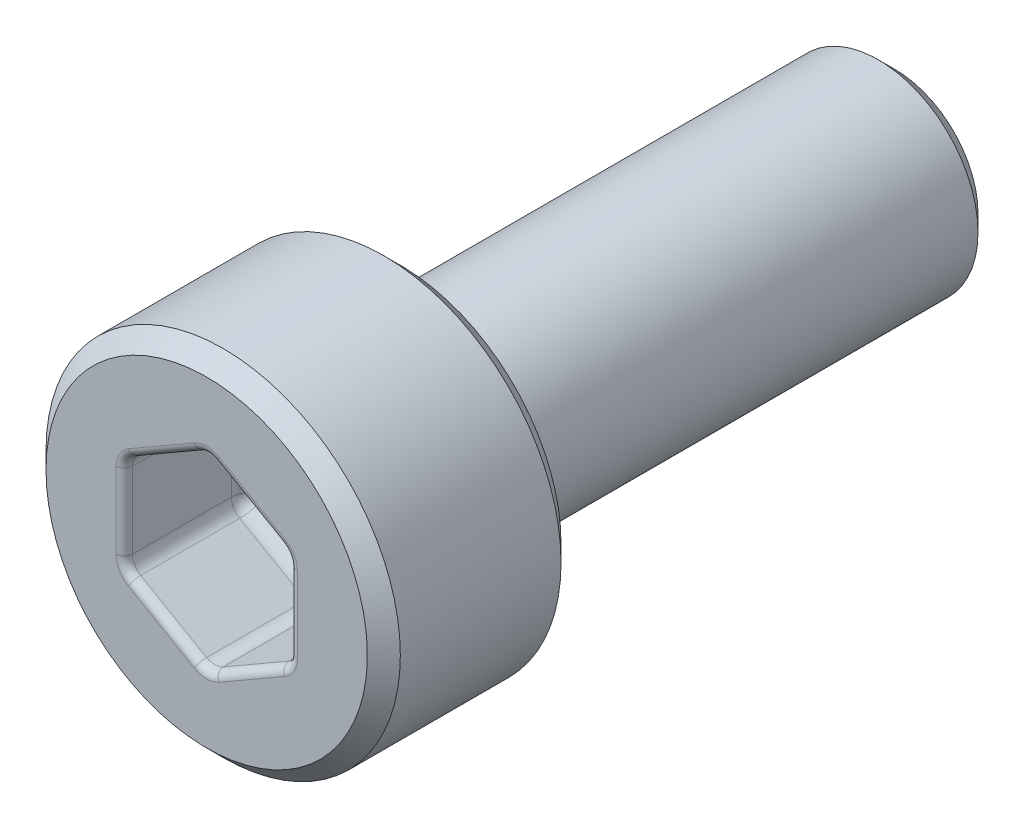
ISO-10303-21;
HEADER;
FILE_DESCRIPTION(('STEP AP214'),'2;1');
FILE_NAME('part.step','',(''),(''),'','','');
FILE_SCHEMA(('AUTOMOTIVE_DESIGN { 1 0 10303 214 1 1 1 1 }'));
ENDSEC;
DATA;
#1=APPLICATION_CONTEXT('core data for automotive mechanical design processes');
#2=APPLICATION_PROTOCOL_DEFINITION('international standard','automotive_design',2000,#1);
#3=PRODUCT_CONTEXT('',#1,'mechanical');
#4=PRODUCT('Part','Part','',(#3));
#5=PRODUCT_RELATED_PRODUCT_CATEGORY('part','',(#4));
#6=PRODUCT_DEFINITION_FORMATION('','',#4);
#7=PRODUCT_DEFINITION_CONTEXT('part definition',#1,'design');
#8=PRODUCT_DEFINITION('design','',#6,#7);
#9=PRODUCT_DEFINITION_SHAPE('','',#8);
#10=(LENGTH_UNIT() NAMED_UNIT(*) SI_UNIT(.MILLI.,.METRE.));
#11=(NAMED_UNIT(*) PLANE_ANGLE_UNIT() SI_UNIT($,.RADIAN.));
#12=(NAMED_UNIT(*) SI_UNIT($,.STERADIAN.) SOLID_ANGLE_UNIT());
#13=UNCERTAINTY_MEASURE_WITH_UNIT(LENGTH_MEASURE(1.E-05),#10,'distance_accuracy_value','');
#14=(GEOMETRIC_REPRESENTATION_CONTEXT(3) GLOBAL_UNCERTAINTY_ASSIGNED_CONTEXT((#13)) GLOBAL_UNIT_ASSIGNED_CONTEXT((#10,
#11,#12)) REPRESENTATION_CONTEXT('',''));
#15=CARTESIAN_POINT('',(0.,0.,0.));
#16=DIRECTION('',(0.,0.,1.));
#17=DIRECTION('',(1.,0.,0.));
#18=AXIS2_PLACEMENT_3D('',#15,#16,#17);
#19=CARTESIAN_POINT('',(0.,0.,2.35));
#20=DIRECTION('',(0.,0.,-1.));
#21=DIRECTION('',(-1.,0.,0.));
#22=AXIS2_PLACEMENT_3D('',#19,#20,#21);
#23=PLANE('',#22);
#24=DIRECTION('',(0.,1.,0.));
#25=VECTOR('',#24,1.);
#26=CARTESIAN_POINT('',(1.1,0.,2.35));
#27=LINE('',#26,#25);
#28=CARTESIAN_POINT('',(1.1,0.4618802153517,2.35));
#29=VERTEX_POINT('',#28);
#30=CARTESIAN_POINT('',(1.1,-0.461880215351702,2.35));
#31=VERTEX_POINT('',#30);
#32=EDGE_CURVE('E268',#29,#31,#27,.F.);
#33=ORIENTED_EDGE('',*,*,#32,.T.);
#34=CARTESIAN_POINT('',(0.8,-0.461880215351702,2.35));
#35=DIRECTION('',(0.,0.,-1.));
#36=DIRECTION('',(-1.,0.,0.));
#37=AXIS2_PLACEMENT_3D('',#34,#35,#36);
#38=CIRCLE('',#37,0.3);
#39=CARTESIAN_POINT('',(0.95,-0.721687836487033,2.35));
#40=VERTEX_POINT('',#39);
#41=EDGE_CURVE('E333',#31,#40,#38,.T.);
#42=ORIENTED_EDGE('',*,*,#41,.T.);
#43=DIRECTION('',(0.866025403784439,0.499999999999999,0.));
#44=VECTOR('',#43,1.);
#45=CARTESIAN_POINT('',(0.549999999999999,-0.952627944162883,2.35));
#46=LINE('',#45,#44);
#47=CARTESIAN_POINT('',(0.149999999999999,-1.18356805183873,2.35));
#48=VERTEX_POINT('',#47);
#49=EDGE_CURVE('E331',#40,#48,#46,.F.);
#50=ORIENTED_EDGE('',*,*,#49,.T.);
#51=CARTESIAN_POINT('',(0.,-0.923760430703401,2.35));
#52=DIRECTION('',(0.,0.,-1.));
#53=DIRECTION('',(-1.,0.,0.));
#54=AXIS2_PLACEMENT_3D('',#51,#52,#53);
#55=CIRCLE('',#54,0.3);
#56=CARTESIAN_POINT('',(-0.150000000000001,-1.18356805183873,2.35));
#57=VERTEX_POINT('',#56);
#58=EDGE_CURVE('E329',#48,#57,#55,.T.);
#59=ORIENTED_EDGE('',*,*,#58,.T.);
#60=DIRECTION('',(0.866025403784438,-0.500000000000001,0.));
#61=VECTOR('',#60,1.);
#62=CARTESIAN_POINT('',(-0.550000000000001,-0.952627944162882,2.35));
#63=LINE('',#62,#61);
#64=CARTESIAN_POINT('',(-0.950000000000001,-0.721687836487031,2.35));
#65=VERTEX_POINT('',#64);
#66=EDGE_CURVE('E327',#57,#65,#63,.F.);
#67=ORIENTED_EDGE('',*,*,#66,.T.);
#68=CARTESIAN_POINT('',(-0.800000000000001,-0.4618802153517,2.35));
#69=DIRECTION('',(0.,0.,-1.));
#70=DIRECTION('',(-1.,0.,0.));
#71=AXIS2_PLACEMENT_3D('',#68,#69,#70);
#72=CIRCLE('',#71,0.3);
#73=CARTESIAN_POINT('',(-1.1,-0.4618802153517,2.35));
#74=VERTEX_POINT('',#73);
#75=EDGE_CURVE('E325',#65,#74,#72,.T.);
#76=ORIENTED_EDGE('',*,*,#75,.T.);
#77=DIRECTION('',(0.,-1.,0.));
#78=VECTOR('',#77,1.);
#79=CARTESIAN_POINT('',(-1.1,0.,2.35));
#80=LINE('',#79,#78);
#81=CARTESIAN_POINT('',(-1.1,0.461880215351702,2.35));
#82=VERTEX_POINT('',#81);
#83=EDGE_CURVE('E323',#74,#82,#80,.F.);
#84=ORIENTED_EDGE('',*,*,#83,.T.);
#85=CARTESIAN_POINT('',(-0.8,0.461880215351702,2.35));
#86=DIRECTION('',(0.,0.,-1.));
#87=DIRECTION('',(-1.,0.,0.));
#88=AXIS2_PLACEMENT_3D('',#85,#86,#87);
#89=CIRCLE('',#88,0.3);
#90=CARTESIAN_POINT('',(-0.95,0.721687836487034,2.35));
#91=VERTEX_POINT('',#90);
#92=EDGE_CURVE('E321',#82,#91,#89,.T.);
#93=ORIENTED_EDGE('',*,*,#92,.T.);
#94=DIRECTION('',(-0.866025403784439,-0.499999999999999,0.));
#95=VECTOR('',#94,1.);
#96=CARTESIAN_POINT('',(-0.549999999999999,0.952627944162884,2.35));
#97=LINE('',#96,#95);
#98=CARTESIAN_POINT('',(-0.149999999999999,1.18356805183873,2.35));
#99=VERTEX_POINT('',#98);
#100=EDGE_CURVE('E319',#91,#99,#97,.F.);
#101=ORIENTED_EDGE('',*,*,#100,.T.);
#102=CARTESIAN_POINT('',(0.,0.923760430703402,2.35));
#103=DIRECTION('',(0.,0.,-1.));
#104=DIRECTION('',(-1.,0.,0.));
#105=AXIS2_PLACEMENT_3D('',#102,#103,#104);
#106=CIRCLE('',#105,0.3);
#107=CARTESIAN_POINT('',(0.150000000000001,1.18356805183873,2.35));
#108=VERTEX_POINT('',#107);
#109=EDGE_CURVE('E317',#99,#108,#106,.T.);
#110=ORIENTED_EDGE('',*,*,#109,.T.);
#111=DIRECTION('',(-0.866025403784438,0.500000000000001,0.));
#112=VECTOR('',#111,1.);
#113=CARTESIAN_POINT('',(0.550000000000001,0.952627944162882,2.35));
#114=LINE('',#113,#112);
#115=CARTESIAN_POINT('',(0.950000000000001,0.721687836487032,2.35));
#116=VERTEX_POINT('',#115);
#117=EDGE_CURVE('E315',#108,#116,#114,.F.);
#118=ORIENTED_EDGE('',*,*,#117,.T.);
#119=CARTESIAN_POINT('',(0.8,0.4618802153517,2.35));
#120=DIRECTION('',(0.,0.,-1.));
#121=DIRECTION('',(-1.,0.,0.));
#122=AXIS2_PLACEMENT_3D('',#119,#120,#121);
#123=CIRCLE('',#122,0.3);
#124=EDGE_CURVE('E313',#116,#29,#123,.T.);
#125=ORIENTED_EDGE('',*,*,#124,.T.);
#126=EDGE_LOOP('',(#33,#42,#50,#59,#67,#76,#84,#93,#101,#110,#118,#125));
#127=FACE_BOUND('',#126,.T.);
#128=CARTESIAN_POINT('',(0.,0.,2.35));
#129=DIRECTION('',(0.,0.,-1.));
#130=DIRECTION('',(-1.,0.,0.));
#131=AXIS2_PLACEMENT_3D('',#128,#129,#130);
#132=CIRCLE('',#131,1.95);
#133=CARTESIAN_POINT('',(-1.95,0.,2.35));
#134=VERTEX_POINT('',#133);
#135=EDGE_CURVE('E311',#134,#134,#132,.F.);
#136=ORIENTED_EDGE('',*,*,#135,.T.);
#137=EDGE_LOOP('',(#136));
#138=FACE_BOUND('',#137,.T.);
#139=ADVANCED_FACE('F39',(#127,#138),#23,.F.);
#140=CARTESIAN_POINT('',(0.,0.,21.9198795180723));
#141=DIRECTION('',(0.,0.,1.));
#142=DIRECTION('',(1.,0.,0.));
#143=AXIS2_PLACEMENT_3D('',#140,#141,#142);
#144=CYLINDRICAL_SURFACE('',#143,2.15);
#145=CARTESIAN_POINT('',(0.,0.,2.15));
#146=DIRECTION('',(0.,0.,-1.));
#147=DIRECTION('',(-1.,0.,0.));
#148=AXIS2_PLACEMENT_3D('',#145,#146,#147);
#149=CIRCLE('',#148,2.15);
#150=CARTESIAN_POINT('',(-2.15,0.,2.15));
#151=VERTEX_POINT('',#150);
#152=EDGE_CURVE('E873',#151,#151,#149,.T.);
#153=ORIENTED_EDGE('',*,*,#152,.T.);
#154=EDGE_LOOP('',(#153));
#155=FACE_BOUND('',#154,.T.);
#156=CARTESIAN_POINT('',(0.,0.,0.199999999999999));
#157=DIRECTION('',(0.,0.,1.));
#158=DIRECTION('',(1.,0.,0.));
#159=AXIS2_PLACEMENT_3D('',#156,#157,#158);
#160=CIRCLE('',#159,2.15);
#161=CARTESIAN_POINT('',(2.15,0.,0.199999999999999));
#162=VERTEX_POINT('',#161);
#163=EDGE_CURVE('E878',#162,#162,#160,.T.);
#164=ORIENTED_EDGE('',*,*,#163,.T.);
#165=EDGE_LOOP('',(#164));
#166=FACE_BOUND('',#165,.T.);
#167=ADVANCED_FACE('F432',(#155,#166),#144,.T.);
#168=CARTESIAN_POINT('',(0.,2.15,0.));
#169=DIRECTION('',(0.,0.,1.));
#170=DIRECTION('',(1.,0.,0.));
#171=AXIS2_PLACEMENT_3D('',#168,#169,#170);
#172=PLANE('',#171);
#173=CARTESIAN_POINT('',(0.,0.,0.));
#174=DIRECTION('',(0.,0.,1.));
#175=DIRECTION('',(1.,0.,0.));
#176=AXIS2_PLACEMENT_3D('',#173,#174,#175);
#177=CIRCLE('',#176,1.41);
#178=CARTESIAN_POINT('',(1.41,0.,0.));
#179=VERTEX_POINT('',#178);
#180=EDGE_CURVE('E263',#179,#179,#177,.T.);
#181=ORIENTED_EDGE('',*,*,#180,.T.);
#182=EDGE_LOOP('',(#181));
#183=FACE_BOUND('',#182,.T.);
#184=CARTESIAN_POINT('',(0.,0.,0.));
#185=DIRECTION('',(0.,0.,1.));
#186=DIRECTION('',(1.,0.,0.));
#187=AXIS2_PLACEMENT_3D('',#184,#185,#186);
#188=CIRCLE('',#187,1.95);
#189=CARTESIAN_POINT('',(1.95,0.,0.));
#190=VERTEX_POINT('',#189);
#191=EDGE_CURVE('E871',#190,#190,#188,.F.);
#192=ORIENTED_EDGE('',*,*,#191,.T.);
#193=EDGE_LOOP('',(#192));
#194=FACE_BOUND('',#193,.T.);
#195=ADVANCED_FACE('F438',(#183,#194),#172,.F.);
#196=CARTESIAN_POINT('',(0.,0.,21.9198795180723));
#197=DIRECTION('',(0.,0.,1.));
#198=DIRECTION('',(1.,0.,0.));
#199=AXIS2_PLACEMENT_3D('',#196,#197,#198);
#200=CYLINDRICAL_SURFACE('',#199,1.21);
#201=CARTESIAN_POINT('',(0.,0.,-0.200000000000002));
#202=DIRECTION('',(0.,0.,1.));
#203=DIRECTION('',(1.,0.,0.));
#204=AXIS2_PLACEMENT_3D('',#201,#202,#203);
#205=CIRCLE('',#204,1.21);
#206=CARTESIAN_POINT('',(1.21,0.,-0.200000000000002));
#207=VERTEX_POINT('',#206);
#208=EDGE_CURVE('E266',#207,#207,#205,.F.);
#209=ORIENTED_EDGE('',*,*,#208,.T.);
#210=EDGE_LOOP('',(#209));
#211=FACE_BOUND('',#210,.T.);
#212=CARTESIAN_POINT('',(0.,0.,-5.8));
#213=DIRECTION('',(0.,0.,1.));
#214=DIRECTION('',(1.,0.,0.));
#215=AXIS2_PLACEMENT_3D('',#212,#213,#214);
#216=CIRCLE('',#215,1.21);
#217=CARTESIAN_POINT('',(1.21,0.,-5.8));
#218=VERTEX_POINT('',#217);
#219=EDGE_CURVE('E872',#218,#218,#216,.T.);
#220=ORIENTED_EDGE('',*,*,#219,.T.);
#221=EDGE_LOOP('',(#220));
#222=FACE_BOUND('',#221,.T.);
#223=ADVANCED_FACE('F813',(#211,#222),#200,.T.);
#224=CARTESIAN_POINT('',(0.,1.21,-6.));
#225=DIRECTION('',(0.,0.,1.));
#226=DIRECTION('',(1.,0.,0.));
#227=AXIS2_PLACEMENT_3D('',#224,#225,#226);
#228=PLANE('',#227);
#229=CARTESIAN_POINT('',(0.,0.,-6.));
#230=DIRECTION('',(0.,0.,1.));
#231=DIRECTION('',(1.,0.,0.));
#232=AXIS2_PLACEMENT_3D('',#229,#230,#231);
#233=CIRCLE('',#232,1.01);
#234=CARTESIAN_POINT('',(1.01,0.,-6.));
#235=VERTEX_POINT('',#234);
#236=EDGE_CURVE('E213',#235,#235,#233,.F.);
#237=ORIENTED_EDGE('',*,*,#236,.T.);
#238=EDGE_LOOP('',(#237));
#239=FACE_BOUND('',#238,.T.);
#240=ADVANCED_FACE('F805',(#239),#228,.F.);
#241=CARTESIAN_POINT('',(0.,-1.15470053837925,0.849999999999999));
#242=DIRECTION('',(0.499999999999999,-0.866025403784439,0.));
#243=DIRECTION('',(0.866025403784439,0.499999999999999,0.));
#244=AXIS2_PLACEMENT_3D('',#241,#242,#243);
#245=PLANE('',#244);
#246=DIRECTION('',(0.,0.,1.));
#247=VECTOR('',#246,1.);
#248=CARTESIAN_POINT('',(0.0999999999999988,-1.09696551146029,2.35));
#249=LINE('',#248,#247);
#250=CARTESIAN_POINT('',(0.0999999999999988,-1.09696551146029,1.05));
#251=VERTEX_POINT('',#250);
#252=CARTESIAN_POINT('',(0.0999999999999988,-1.09696551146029,2.25));
#253=VERTEX_POINT('',#252);
#254=EDGE_CURVE('E260',#251,#253,#249,.T.);
#255=ORIENTED_EDGE('',*,*,#254,.T.);
#256=DIRECTION('',(0.866025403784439,0.499999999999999,0.));
#257=VECTOR('',#256,1.);
#258=CARTESIAN_POINT('',(0.,-1.15470053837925,2.25));
#259=LINE('',#258,#257);
#260=CARTESIAN_POINT('',(0.899999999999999,-0.635085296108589,2.25));
#261=VERTEX_POINT('',#260);
#262=EDGE_CURVE('E339',#253,#261,#259,.T.);
#263=ORIENTED_EDGE('',*,*,#262,.T.);
#264=DIRECTION('',(0.,0.,1.));
#265=VECTOR('',#264,1.);
#266=CARTESIAN_POINT('',(0.899999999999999,-0.635085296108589,0.849999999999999));
#267=LINE('',#266,#265);
#268=CARTESIAN_POINT('',(0.899999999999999,-0.635085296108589,1.05));
#269=VERTEX_POINT('',#268);
#270=EDGE_CURVE('E256',#261,#269,#267,.F.);
#271=ORIENTED_EDGE('',*,*,#270,.T.);
#272=DIRECTION('',(0.866025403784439,0.499999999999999,0.));
#273=VECTOR('',#272,1.);
#274=CARTESIAN_POINT('',(0.,-1.15470053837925,1.05));
#275=LINE('',#274,#273);
#276=EDGE_CURVE('E258',#269,#251,#275,.F.);
#277=ORIENTED_EDGE('',*,*,#276,.T.);
#278=EDGE_LOOP('',(#255,#263,#271,#277));
#279=FACE_BOUND('',#278,.T.);
#280=ADVANCED_FACE('F796',(#279),#245,.F.);
#281=CARTESIAN_POINT('',(-1.,-0.577350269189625,0.849999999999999));
#282=DIRECTION('',(-0.500000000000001,-0.866025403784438,0.));
#283=DIRECTION('',(0.866025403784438,-0.500000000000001,0.));
#284=AXIS2_PLACEMENT_3D('',#281,#282,#283);
#285=PLANE('',#284);
#286=DIRECTION('',(0.,0.,1.));
#287=VECTOR('',#286,1.);
#288=CARTESIAN_POINT('',(-0.900000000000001,-0.635085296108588,2.35));
#289=LINE('',#288,#287);
#290=CARTESIAN_POINT('',(-0.900000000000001,-0.635085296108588,1.05));
#291=VERTEX_POINT('',#290);
#292=CARTESIAN_POINT('',(-0.900000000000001,-0.635085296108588,2.25));
#293=VERTEX_POINT('',#292);
#294=EDGE_CURVE('E227',#291,#293,#289,.T.);
#295=ORIENTED_EDGE('',*,*,#294,.T.);
#296=DIRECTION('',(0.866025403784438,-0.500000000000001,0.));
#297=VECTOR('',#296,1.);
#298=CARTESIAN_POINT('',(-1.,-0.577350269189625,2.25));
#299=LINE('',#298,#297);
#300=CARTESIAN_POINT('',(-0.100000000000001,-1.09696551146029,2.25));
#301=VERTEX_POINT('',#300);
#302=EDGE_CURVE('E343',#293,#301,#299,.T.);
#303=ORIENTED_EDGE('',*,*,#302,.T.);
#304=DIRECTION('',(0.,0.,1.));
#305=VECTOR('',#304,1.);
#306=CARTESIAN_POINT('',(-0.100000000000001,-1.09696551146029,0.849999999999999));
#307=LINE('',#306,#305);
#308=CARTESIAN_POINT('',(-0.100000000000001,-1.09696551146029,1.05));
#309=VERTEX_POINT('',#308);
#310=EDGE_CURVE('E219',#301,#309,#307,.F.);
#311=ORIENTED_EDGE('',*,*,#310,.T.);
#312=DIRECTION('',(0.866025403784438,-0.500000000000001,0.));
#313=VECTOR('',#312,1.);
#314=CARTESIAN_POINT('',(-1.,-0.577350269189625,1.05));
#315=LINE('',#314,#313);
#316=EDGE_CURVE('E190',#309,#291,#315,.F.);
#317=ORIENTED_EDGE('',*,*,#316,.T.);
#318=EDGE_LOOP('',(#295,#303,#311,#317));
#319=FACE_BOUND('',#318,.T.);
#320=ADVANCED_FACE('F788',(#319),#285,.F.);
#321=CARTESIAN_POINT('',(-1.,0.577350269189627,0.849999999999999));
#322=DIRECTION('',(-1.,0.,0.));
#323=DIRECTION('',(0.,-1.,0.));
#324=AXIS2_PLACEMENT_3D('',#321,#322,#323);
#325=PLANE('',#324);
#326=DIRECTION('',(0.,0.,1.));
#327=VECTOR('',#326,1.);
#328=CARTESIAN_POINT('',(-1.,0.461880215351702,2.35));
#329=LINE('',#328,#327);
#330=CARTESIAN_POINT('',(-1.,0.461880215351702,1.05));
#331=VERTEX_POINT('',#330);
#332=CARTESIAN_POINT('',(-1.,0.461880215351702,2.25));
#333=VERTEX_POINT('',#332);
#334=EDGE_CURVE('E230',#331,#333,#329,.T.);
#335=ORIENTED_EDGE('',*,*,#334,.T.);
#336=DIRECTION('',(0.,-1.,0.));
#337=VECTOR('',#336,1.);
#338=CARTESIAN_POINT('',(-1.,0.577350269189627,2.25));
#339=LINE('',#338,#337);
#340=CARTESIAN_POINT('',(-1.,-0.4618802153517,2.25));
#341=VERTEX_POINT('',#340);
#342=EDGE_CURVE('E347',#333,#341,#339,.T.);
#343=ORIENTED_EDGE('',*,*,#342,.T.);
#344=DIRECTION('',(0.,0.,1.));
#345=VECTOR('',#344,1.);
#346=CARTESIAN_POINT('',(-1.,-0.4618802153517,0.849999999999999));
#347=LINE('',#346,#345);
#348=CARTESIAN_POINT('',(-1.,-0.4618802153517,1.05));
#349=VERTEX_POINT('',#348);
#350=EDGE_CURVE('E235',#341,#349,#347,.F.);
#351=ORIENTED_EDGE('',*,*,#350,.T.);
#352=DIRECTION('',(0.,-1.,0.));
#353=VECTOR('',#352,1.);
#354=CARTESIAN_POINT('',(-1.,0.577350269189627,1.05));
#355=LINE('',#354,#353);
#356=EDGE_CURVE('E233',#349,#331,#355,.F.);
#357=ORIENTED_EDGE('',*,*,#356,.T.);
#358=EDGE_LOOP('',(#335,#343,#351,#357));
#359=FACE_BOUND('',#358,.T.);
#360=ADVANCED_FACE('F407',(#359),#325,.F.);
#361=CARTESIAN_POINT('',(0.,1.15470053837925,0.849999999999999));
#362=DIRECTION('',(-0.499999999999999,0.866025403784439,0.));
#363=DIRECTION('',(-0.866025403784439,-0.499999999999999,0.));
#364=AXIS2_PLACEMENT_3D('',#361,#362,#363);
#365=PLANE('',#364);
#366=DIRECTION('',(0.,0.,1.));
#367=VECTOR('',#366,1.);
#368=CARTESIAN_POINT('',(-0.0999999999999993,1.09696551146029,2.35));
#369=LINE('',#368,#367);
#370=CARTESIAN_POINT('',(-0.0999999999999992,1.09696551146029,1.05));
#371=VERTEX_POINT('',#370);
#372=CARTESIAN_POINT('',(-0.0999999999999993,1.09696551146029,2.25));
#373=VERTEX_POINT('',#372);
#374=EDGE_CURVE('E241',#371,#373,#369,.T.);
#375=ORIENTED_EDGE('',*,*,#374,.T.);
#376=DIRECTION('',(-0.866025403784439,-0.499999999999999,0.));
#377=VECTOR('',#376,1.);
#378=CARTESIAN_POINT('',(0.,1.15470053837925,2.25));
#379=LINE('',#378,#377);
#380=CARTESIAN_POINT('',(-0.9,0.63508529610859,2.25));
#381=VERTEX_POINT('',#380);
#382=EDGE_CURVE('E351',#373,#381,#379,.T.);
#383=ORIENTED_EDGE('',*,*,#382,.T.);
#384=DIRECTION('',(0.,0.,1.));
#385=VECTOR('',#384,1.);
#386=CARTESIAN_POINT('',(-0.9,0.63508529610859,0.849999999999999));
#387=LINE('',#386,#385);
#388=CARTESIAN_POINT('',(-0.9,0.63508529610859,1.05));
#389=VERTEX_POINT('',#388);
#390=EDGE_CURVE('E237',#381,#389,#387,.F.);
#391=ORIENTED_EDGE('',*,*,#390,.T.);
#392=DIRECTION('',(-0.866025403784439,-0.499999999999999,0.));
#393=VECTOR('',#392,1.);
#394=CARTESIAN_POINT('',(0.,1.15470053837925,1.05));
#395=LINE('',#394,#393);
#396=EDGE_CURVE('E239',#389,#371,#395,.F.);
#397=ORIENTED_EDGE('',*,*,#396,.T.);
#398=EDGE_LOOP('',(#375,#383,#391,#397));
#399=FACE_BOUND('',#398,.T.);
#400=ADVANCED_FACE('F771',(#399),#365,.F.);
#401=CARTESIAN_POINT('',(1.,0.577350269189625,0.849999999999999));
#402=DIRECTION('',(0.500000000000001,0.866025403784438,0.));
#403=DIRECTION('',(-0.866025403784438,0.500000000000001,0.));
#404=AXIS2_PLACEMENT_3D('',#401,#402,#403);
#405=PLANE('',#404);
#406=DIRECTION('',(0.,0.,1.));
#407=VECTOR('',#406,1.);
#408=CARTESIAN_POINT('',(0.9,0.635085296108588,2.35));
#409=LINE('',#408,#407);
#410=CARTESIAN_POINT('',(0.9,0.635085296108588,1.05));
#411=VERTEX_POINT('',#410);
#412=CARTESIAN_POINT('',(0.9,0.635085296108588,2.25));
#413=VERTEX_POINT('',#412);
#414=EDGE_CURVE('E248',#411,#413,#409,.T.);
#415=ORIENTED_EDGE('',*,*,#414,.T.);
#416=DIRECTION('',(-0.866025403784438,0.500000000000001,0.));
#417=VECTOR('',#416,1.);
#418=CARTESIAN_POINT('',(1.,0.577350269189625,2.25));
#419=LINE('',#418,#417);
#420=CARTESIAN_POINT('',(0.100000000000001,1.09696551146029,2.25));
#421=VERTEX_POINT('',#420);
#422=EDGE_CURVE('E355',#413,#421,#419,.T.);
#423=ORIENTED_EDGE('',*,*,#422,.T.);
#424=DIRECTION('',(0.,0.,1.));
#425=VECTOR('',#424,1.);
#426=CARTESIAN_POINT('',(0.100000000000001,1.09696551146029,0.849999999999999));
#427=LINE('',#426,#425);
#428=CARTESIAN_POINT('',(0.100000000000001,1.09696551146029,1.05));
#429=VERTEX_POINT('',#428);
#430=EDGE_CURVE('E244',#421,#429,#427,.F.);
#431=ORIENTED_EDGE('',*,*,#430,.T.);
#432=DIRECTION('',(-0.866025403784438,0.500000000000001,0.));
#433=VECTOR('',#432,1.);
#434=CARTESIAN_POINT('',(1.,0.577350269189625,1.05));
#435=LINE('',#434,#433);
#436=EDGE_CURVE('E246',#429,#411,#435,.F.);
#437=ORIENTED_EDGE('',*,*,#436,.T.);
#438=EDGE_LOOP('',(#415,#423,#431,#437));
#439=FACE_BOUND('',#438,.T.);
#440=ADVANCED_FACE('F763',(#439),#405,.F.);
#441=CARTESIAN_POINT('',(1.,-0.577350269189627,0.849999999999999));
#442=DIRECTION('',(1.,0.,0.));
#443=DIRECTION('',(0.,1.,0.));
#444=AXIS2_PLACEMENT_3D('',#441,#442,#443);
#445=PLANE('',#444);
#446=DIRECTION('',(0.,0.,1.));
#447=VECTOR('',#446,1.);
#448=CARTESIAN_POINT('',(1.,-0.461880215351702,2.35));
#449=LINE('',#448,#447);
#450=CARTESIAN_POINT('',(1.,-0.461880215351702,1.05));
#451=VERTEX_POINT('',#450);
#452=CARTESIAN_POINT('',(1.,-0.461880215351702,2.25));
#453=VERTEX_POINT('',#452);
#454=EDGE_CURVE('E254',#451,#453,#449,.T.);
#455=ORIENTED_EDGE('',*,*,#454,.T.);
#456=DIRECTION('',(0.,1.,0.));
#457=VECTOR('',#456,1.);
#458=CARTESIAN_POINT('',(1.,-0.577350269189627,2.25));
#459=LINE('',#458,#457);
#460=CARTESIAN_POINT('',(1.,0.4618802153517,2.25));
#461=VERTEX_POINT('',#460);
#462=EDGE_CURVE('E11',#453,#461,#459,.T.);
#463=ORIENTED_EDGE('',*,*,#462,.T.);
#464=DIRECTION('',(0.,0.,1.));
#465=VECTOR('',#464,1.);
#466=CARTESIAN_POINT('',(1.,0.4618802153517,0.849999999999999));
#467=LINE('',#466,#465);
#468=CARTESIAN_POINT('',(1.,0.4618802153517,1.05));
#469=VERTEX_POINT('',#468);
#470=EDGE_CURVE('E250',#461,#469,#467,.F.);
#471=ORIENTED_EDGE('',*,*,#470,.T.);
#472=DIRECTION('',(0.,1.,0.));
#473=VECTOR('',#472,1.);
#474=CARTESIAN_POINT('',(1.,-0.577350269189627,1.05));
#475=LINE('',#474,#473);
#476=EDGE_CURVE('E252',#469,#451,#475,.F.);
#477=ORIENTED_EDGE('',*,*,#476,.T.);
#478=EDGE_LOOP('',(#455,#463,#471,#477));
#479=FACE_BOUND('',#478,.T.);
#480=ADVANCED_FACE('F755',(#479),#445,.F.);
#481=CARTESIAN_POINT('',(0.,0.,0.849999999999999));
#482=DIRECTION('',(0.,0.,1.));
#483=DIRECTION('',(1.,0.,0.));
#484=AXIS2_PLACEMENT_3D('',#481,#482,#483);
#485=PLANE('',#484);
#486=DIRECTION('',(0.,-1.,0.));
#487=VECTOR('',#486,1.);
#488=CARTESIAN_POINT('',(-0.8,0.,0.849999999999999));
#489=LINE('',#488,#487);
#490=CARTESIAN_POINT('',(-0.8,0.461880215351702,0.849999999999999));
#491=VERTEX_POINT('',#490);
#492=CARTESIAN_POINT('',(-0.800000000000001,-0.4618802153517,0.849999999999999));
#493=VERTEX_POINT('',#492);
#494=EDGE_CURVE('E217',#491,#493,#489,.T.);
#495=ORIENTED_EDGE('',*,*,#494,.T.);
#496=DIRECTION('',(0.866025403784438,-0.500000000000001,0.));
#497=VECTOR('',#496,1.);
#498=CARTESIAN_POINT('',(-0.400000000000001,-0.692820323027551,0.849999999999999));
#499=LINE('',#498,#497);
#500=CARTESIAN_POINT('',(0.,-0.923760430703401,0.849999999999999));
#501=VERTEX_POINT('',#500);
#502=EDGE_CURVE('E188',#493,#501,#499,.T.);
#503=ORIENTED_EDGE('',*,*,#502,.T.);
#504=DIRECTION('',(0.866025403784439,0.499999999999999,0.));
#505=VECTOR('',#504,1.);
#506=CARTESIAN_POINT('',(0.399999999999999,-0.692820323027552,0.849999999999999));
#507=LINE('',#506,#505);
#508=CARTESIAN_POINT('',(0.8,-0.461880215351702,0.849999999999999));
#509=VERTEX_POINT('',#508);
#510=EDGE_CURVE('E206',#501,#509,#507,.T.);
#511=ORIENTED_EDGE('',*,*,#510,.T.);
#512=DIRECTION('',(0.,1.,0.));
#513=VECTOR('',#512,1.);
#514=CARTESIAN_POINT('',(0.8,0.,0.849999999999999));
#515=LINE('',#514,#513);
#516=CARTESIAN_POINT('',(0.8,0.4618802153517,0.849999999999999));
#517=VERTEX_POINT('',#516);
#518=EDGE_CURVE('E212',#509,#517,#515,.T.);
#519=ORIENTED_EDGE('',*,*,#518,.T.);
#520=DIRECTION('',(-0.866025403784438,0.500000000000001,0.));
#521=VECTOR('',#520,1.);
#522=CARTESIAN_POINT('',(0.400000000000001,0.692820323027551,0.849999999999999));
#523=LINE('',#522,#521);
#524=CARTESIAN_POINT('',(0.,0.923760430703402,0.849999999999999));
#525=VERTEX_POINT('',#524);
#526=EDGE_CURVE('E885',#517,#525,#523,.T.);
#527=ORIENTED_EDGE('',*,*,#526,.T.);
#528=DIRECTION('',(-0.866025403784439,-0.499999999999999,0.));
#529=VECTOR('',#528,1.);
#530=CARTESIAN_POINT('',(-0.4,0.692820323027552,0.849999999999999));
#531=LINE('',#530,#529);
#532=EDGE_CURVE('E222',#525,#491,#531,.T.);
#533=ORIENTED_EDGE('',*,*,#532,.T.);
#534=EDGE_LOOP('',(#495,#503,#511,#519,#527,#533));
#535=FACE_BOUND('',#534,.T.);
#536=ADVANCED_FACE('F215',(#535),#485,.T.);
#537=CARTESIAN_POINT('',(0.,0.,2.35));
#538=DIRECTION('',(0.,0.,-1.));
#539=DIRECTION('',(-1.,0.,0.));
#540=AXIS2_PLACEMENT_3D('',#537,#538,#539);
#541=CONICAL_SURFACE('',#540,1.95,0.78539816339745);
#542=ORIENTED_EDGE('',*,*,#152,.F.);
#543=EDGE_LOOP('',(#542));
#544=FACE_BOUND('',#543,.T.);
#545=ORIENTED_EDGE('',*,*,#135,.F.);
#546=EDGE_LOOP('',(#545));
#547=FACE_BOUND('',#546,.T.);
#548=ADVANCED_FACE('F444',(#544,#547),#541,.T.);
#549=CARTESIAN_POINT('',(0.,0.,0.199999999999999));
#550=DIRECTION('',(0.,0.,1.));
#551=DIRECTION('',(1.,0.,0.));
#552=AXIS2_PLACEMENT_3D('',#549,#550,#551);
#553=CONICAL_SURFACE('',#552,2.15,0.785398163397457);
#554=ORIENTED_EDGE('',*,*,#191,.F.);
#555=EDGE_LOOP('',(#554));
#556=FACE_BOUND('',#555,.T.);
#557=ORIENTED_EDGE('',*,*,#163,.F.);
#558=EDGE_LOOP('',(#557));
#559=FACE_BOUND('',#558,.T.);
#560=ADVANCED_FACE('F447',(#556,#559),#553,.T.);
#561=CARTESIAN_POINT('',(0.,0.,-5.8));
#562=DIRECTION('',(0.,0.,1.));
#563=DIRECTION('',(1.,0.,0.));
#564=AXIS2_PLACEMENT_3D('',#561,#562,#563);
#565=CONICAL_SURFACE('',#564,1.21,0.78539816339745);
#566=ORIENTED_EDGE('',*,*,#236,.F.);
#567=EDGE_LOOP('',(#566));
#568=FACE_BOUND('',#567,.T.);
#569=ORIENTED_EDGE('',*,*,#219,.F.);
#570=EDGE_LOOP('',(#569));
#571=FACE_BOUND('',#570,.T.);
#572=ADVANCED_FACE('F451',(#568,#571),#565,.T.);
#573=CARTESIAN_POINT('',(0.,0.923760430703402,0.849999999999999));
#574=DIRECTION('',(0.,0.,-1.));
#575=DIRECTION('',(-1.,0.,0.));
#576=AXIS2_PLACEMENT_3D('',#573,#574,#575);
#577=CYLINDRICAL_SURFACE('',#576,0.2);
#578=ORIENTED_EDGE('',*,*,#430,.F.);
#579=CARTESIAN_POINT('',(0.,0.923760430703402,2.25));
#580=DIRECTION('',(0.,0.,-1.));
#581=DIRECTION('',(-1.,0.,0.));
#582=AXIS2_PLACEMENT_3D('',#579,#580,#581);
#583=CIRCLE('',#582,0.2);
#584=EDGE_CURVE('E353',#421,#373,#583,.F.);
#585=ORIENTED_EDGE('',*,*,#584,.T.);
#586=ORIENTED_EDGE('',*,*,#374,.F.);
#587=CARTESIAN_POINT('',(0.,0.923760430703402,1.05));
#588=DIRECTION('',(0.,0.,1.));
#589=DIRECTION('',(1.,0.,0.));
#590=AXIS2_PLACEMENT_3D('',#587,#588,#589);
#591=CIRCLE('',#590,0.2);
#592=EDGE_CURVE('E308',#429,#371,#591,.T.);
#593=ORIENTED_EDGE('',*,*,#592,.F.);
#594=EDGE_LOOP('',(#578,#585,#586,#593));
#595=FACE_BOUND('',#594,.T.);
#596=ADVANCED_FACE('F455',(#595),#577,.F.);
#597=CARTESIAN_POINT('',(0.400000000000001,0.692820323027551,1.05));
#598=DIRECTION('',(-0.866025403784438,0.500000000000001,0.));
#599=DIRECTION('',(-0.500000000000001,-0.866025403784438,0.));
#600=AXIS2_PLACEMENT_3D('',#597,#598,#599);
#601=CYLINDRICAL_SURFACE('',#600,0.2);
#602=CARTESIAN_POINT('',(0.8,0.4618802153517,1.05));
#603=DIRECTION('',(-0.866025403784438,0.500000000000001,0.));
#604=DIRECTION('',(-0.500000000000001,-0.866025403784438,0.));
#605=AXIS2_PLACEMENT_3D('',#602,#603,#604);
#606=CIRCLE('',#605,0.2);
#607=EDGE_CURVE('E302',#411,#517,#606,.T.);
#608=ORIENTED_EDGE('',*,*,#607,.F.);
#609=ORIENTED_EDGE('',*,*,#436,.F.);
#610=CARTESIAN_POINT('',(0.,0.923760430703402,1.05));
#611=DIRECTION('',(0.866025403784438,-0.500000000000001,0.));
#612=DIRECTION('',(0.500000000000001,0.866025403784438,0.));
#613=AXIS2_PLACEMENT_3D('',#610,#611,#612);
#614=CIRCLE('',#613,0.2);
#615=EDGE_CURVE('E305',#525,#429,#614,.T.);
#616=ORIENTED_EDGE('',*,*,#615,.F.);
#617=ORIENTED_EDGE('',*,*,#526,.F.);
#618=EDGE_LOOP('',(#608,#609,#616,#617));
#619=FACE_BOUND('',#618,.T.);
#620=ADVANCED_FACE('F716',(#619),#601,.F.);
#621=CARTESIAN_POINT('',(0.8,0.4618802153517,0.849999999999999));
#622=DIRECTION('',(0.,0.,-1.));
#623=DIRECTION('',(-1.,0.,0.));
#624=AXIS2_PLACEMENT_3D('',#621,#622,#623);
#625=CYLINDRICAL_SURFACE('',#624,0.2);
#626=ORIENTED_EDGE('',*,*,#470,.F.);
#627=CARTESIAN_POINT('',(0.8,0.4618802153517,2.25));
#628=DIRECTION('',(0.,0.,-1.));
#629=DIRECTION('',(-1.,0.,0.));
#630=AXIS2_PLACEMENT_3D('',#627,#628,#629);
#631=CIRCLE('',#630,0.2);
#632=EDGE_CURVE('E48',#461,#413,#631,.F.);
#633=ORIENTED_EDGE('',*,*,#632,.T.);
#634=ORIENTED_EDGE('',*,*,#414,.F.);
#635=CARTESIAN_POINT('',(0.8,0.4618802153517,1.05));
#636=DIRECTION('',(0.,0.,1.));
#637=DIRECTION('',(1.,0.,0.));
#638=AXIS2_PLACEMENT_3D('',#635,#636,#637);
#639=CIRCLE('',#638,0.2);
#640=EDGE_CURVE('E299',#469,#411,#639,.T.);
#641=ORIENTED_EDGE('',*,*,#640,.F.);
#642=EDGE_LOOP('',(#626,#633,#634,#641));
#643=FACE_BOUND('',#642,.T.);
#644=ADVANCED_FACE('F707',(#643),#625,.F.);
#645=CARTESIAN_POINT('',(0.,0.923760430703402,1.05));
#646=DIRECTION('',(0.,0.,1.));
#647=DIRECTION('',(1.,0.,0.));
#648=AXIS2_PLACEMENT_3D('',#645,#646,#647);
#649=SPHERICAL_SURFACE('',#648,0.2);
#650=ORIENTED_EDGE('',*,*,#615,.T.);
#651=ORIENTED_EDGE('',*,*,#592,.T.);
#652=CARTESIAN_POINT('',(0.,0.923760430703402,1.05));
#653=DIRECTION('',(-0.866025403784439,-0.499999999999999,0.));
#654=DIRECTION('',(0.499999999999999,-0.866025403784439,0.));
#655=AXIS2_PLACEMENT_3D('',#652,#653,#654);
#656=CIRCLE('',#655,0.2);
#657=EDGE_CURVE('E296',#525,#371,#656,.F.);
#658=ORIENTED_EDGE('',*,*,#657,.F.);
#659=EDGE_LOOP('',(#650,#651,#658));
#660=FACE_BOUND('',#659,.T.);
#661=ADVANCED_FACE('F698',(#660),#649,.F.);
#662=CARTESIAN_POINT('',(0.8,0.4618802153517,1.05));
#663=DIRECTION('',(0.,0.,1.));
#664=DIRECTION('',(1.,0.,0.));
#665=AXIS2_PLACEMENT_3D('',#662,#663,#664);
#666=SPHERICAL_SURFACE('',#665,0.2);
#667=ORIENTED_EDGE('',*,*,#640,.T.);
#668=ORIENTED_EDGE('',*,*,#607,.T.);
#669=CARTESIAN_POINT('',(0.8,0.4618802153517,1.05));
#670=DIRECTION('',(0.,-1.,0.));
#671=DIRECTION('',(1.,0.,0.));
#672=AXIS2_PLACEMENT_3D('',#669,#670,#671);
#673=CIRCLE('',#672,0.2);
#674=EDGE_CURVE('E293',#469,#517,#673,.F.);
#675=ORIENTED_EDGE('',*,*,#674,.F.);
#676=EDGE_LOOP('',(#667,#668,#675));
#677=FACE_BOUND('',#676,.T.);
#678=ADVANCED_FACE('F690',(#677),#666,.F.);
#679=CARTESIAN_POINT('',(-0.8,0.461880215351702,0.849999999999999));
#680=DIRECTION('',(0.,0.,-1.));
#681=DIRECTION('',(-1.,0.,0.));
#682=AXIS2_PLACEMENT_3D('',#679,#680,#681);
#683=CYLINDRICAL_SURFACE('',#682,0.2);
#684=ORIENTED_EDGE('',*,*,#390,.F.);
#685=CARTESIAN_POINT('',(-0.8,0.461880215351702,2.25));
#686=DIRECTION('',(0.,0.,-1.));
#687=DIRECTION('',(-1.,0.,0.));
#688=AXIS2_PLACEMENT_3D('',#685,#686,#687);
#689=CIRCLE('',#688,0.2);
#690=EDGE_CURVE('E349',#381,#333,#689,.F.);
#691=ORIENTED_EDGE('',*,*,#690,.T.);
#692=ORIENTED_EDGE('',*,*,#334,.F.);
#693=CARTESIAN_POINT('',(-0.8,0.461880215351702,1.05));
#694=DIRECTION('',(0.,0.,1.));
#695=DIRECTION('',(1.,0.,0.));
#696=AXIS2_PLACEMENT_3D('',#693,#694,#695);
#697=CIRCLE('',#696,0.2);
#698=EDGE_CURVE('E290',#389,#331,#697,.T.);
#699=ORIENTED_EDGE('',*,*,#698,.F.);
#700=EDGE_LOOP('',(#684,#691,#692,#699));
#701=FACE_BOUND('',#700,.T.);
#702=ADVANCED_FACE('F404',(#701),#683,.F.);
#703=CARTESIAN_POINT('',(-0.4,0.692820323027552,1.05));
#704=DIRECTION('',(-0.866025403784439,-0.499999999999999,0.));
#705=DIRECTION('',(0.499999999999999,-0.866025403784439,0.));
#706=AXIS2_PLACEMENT_3D('',#703,#704,#705);
#707=CYLINDRICAL_SURFACE('',#706,0.2);
#708=ORIENTED_EDGE('',*,*,#657,.T.);
#709=ORIENTED_EDGE('',*,*,#396,.F.);
#710=CARTESIAN_POINT('',(-0.8,0.461880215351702,1.05));
#711=DIRECTION('',(0.866025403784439,0.499999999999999,0.));
#712=DIRECTION('',(-0.499999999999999,0.866025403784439,0.));
#713=AXIS2_PLACEMENT_3D('',#710,#711,#712);
#714=CIRCLE('',#713,0.2);
#715=EDGE_CURVE('E287',#491,#389,#714,.T.);
#716=ORIENTED_EDGE('',*,*,#715,.F.);
#717=ORIENTED_EDGE('',*,*,#532,.F.);
#718=EDGE_LOOP('',(#708,#709,#716,#717));
#719=FACE_BOUND('',#718,.T.);
#720=ADVANCED_FACE('F673',(#719),#707,.F.);
#721=CARTESIAN_POINT('',(0.8,0.,1.05));
#722=DIRECTION('',(0.,1.,0.));
#723=DIRECTION('',(-1.,0.,0.));
#724=AXIS2_PLACEMENT_3D('',#721,#722,#723);
#725=CYLINDRICAL_SURFACE('',#724,0.2);
#726=ORIENTED_EDGE('',*,*,#674,.T.);
#727=ORIENTED_EDGE('',*,*,#518,.F.);
#728=CARTESIAN_POINT('',(0.8,-0.461880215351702,1.05));
#729=DIRECTION('',(0.,1.,0.));
#730=DIRECTION('',(-1.,0.,0.));
#731=AXIS2_PLACEMENT_3D('',#728,#729,#730);
#732=CIRCLE('',#731,0.2);
#733=EDGE_CURVE('E284',#451,#509,#732,.T.);
#734=ORIENTED_EDGE('',*,*,#733,.F.);
#735=ORIENTED_EDGE('',*,*,#476,.F.);
#736=EDGE_LOOP('',(#726,#727,#734,#735));
#737=FACE_BOUND('',#736,.T.);
#738=ADVANCED_FACE('F664',(#737),#725,.F.);
#739=CARTESIAN_POINT('',(0.8,-0.461880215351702,0.849999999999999));
#740=DIRECTION('',(0.,0.,-1.));
#741=DIRECTION('',(-1.,0.,0.));
#742=AXIS2_PLACEMENT_3D('',#739,#740,#741);
#743=CYLINDRICAL_SURFACE('',#742,0.2);
#744=ORIENTED_EDGE('',*,*,#270,.F.);
#745=CARTESIAN_POINT('',(0.8,-0.461880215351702,2.25));
#746=DIRECTION('',(0.,0.,-1.));
#747=DIRECTION('',(-1.,0.,0.));
#748=AXIS2_PLACEMENT_3D('',#745,#746,#747);
#749=CIRCLE('',#748,0.2);
#750=EDGE_CURVE('E336',#261,#453,#749,.F.);
#751=ORIENTED_EDGE('',*,*,#750,.T.);
#752=ORIENTED_EDGE('',*,*,#454,.F.);
#753=CARTESIAN_POINT('',(0.8,-0.461880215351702,1.05));
#754=DIRECTION('',(0.,0.,1.));
#755=DIRECTION('',(1.,0.,0.));
#756=AXIS2_PLACEMENT_3D('',#753,#754,#755);
#757=CIRCLE('',#756,0.2);
#758=EDGE_CURVE('E281',#269,#451,#757,.T.);
#759=ORIENTED_EDGE('',*,*,#758,.F.);
#760=EDGE_LOOP('',(#744,#751,#752,#759));
#761=FACE_BOUND('',#760,.T.);
#762=ADVANCED_FACE('F655',(#761),#743,.F.);
#763=CARTESIAN_POINT('',(-0.8,0.461880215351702,1.05));
#764=DIRECTION('',(0.,0.,1.));
#765=DIRECTION('',(1.,0.,0.));
#766=AXIS2_PLACEMENT_3D('',#763,#764,#765);
#767=SPHERICAL_SURFACE('',#766,0.2);
#768=ORIENTED_EDGE('',*,*,#715,.T.);
#769=ORIENTED_EDGE('',*,*,#698,.T.);
#770=CARTESIAN_POINT('',(-0.8,0.461880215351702,1.05));
#771=DIRECTION('',(0.,-1.,0.));
#772=DIRECTION('',(1.,0.,0.));
#773=AXIS2_PLACEMENT_3D('',#770,#771,#772);
#774=CIRCLE('',#773,0.2);
#775=EDGE_CURVE('E278',#491,#331,#774,.F.);
#776=ORIENTED_EDGE('',*,*,#775,.F.);
#777=EDGE_LOOP('',(#768,#769,#776));
#778=FACE_BOUND('',#777,.T.);
#779=ADVANCED_FACE('F646',(#778),#767,.F.);
#780=CARTESIAN_POINT('',(0.8,-0.461880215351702,1.05));
#781=DIRECTION('',(0.,0.,1.));
#782=DIRECTION('',(1.,0.,0.));
#783=AXIS2_PLACEMENT_3D('',#780,#781,#782);
#784=SPHERICAL_SURFACE('',#783,0.2);
#785=ORIENTED_EDGE('',*,*,#758,.T.);
#786=ORIENTED_EDGE('',*,*,#733,.T.);
#787=CARTESIAN_POINT('',(0.8,-0.461880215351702,1.05));
#788=DIRECTION('',(-0.866025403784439,-0.499999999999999,0.));
#789=DIRECTION('',(0.499999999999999,-0.866025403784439,0.));
#790=AXIS2_PLACEMENT_3D('',#787,#788,#789);
#791=CIRCLE('',#790,0.2);
#792=EDGE_CURVE('E209',#269,#509,#791,.F.);
#793=ORIENTED_EDGE('',*,*,#792,.F.);
#794=EDGE_LOOP('',(#785,#786,#793));
#795=FACE_BOUND('',#794,.T.);
#796=ADVANCED_FACE('F638',(#795),#784,.F.);
#797=CARTESIAN_POINT('',(-0.800000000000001,-0.4618802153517,0.849999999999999));
#798=DIRECTION('',(0.,0.,-1.));
#799=DIRECTION('',(-1.,0.,0.));
#800=AXIS2_PLACEMENT_3D('',#797,#798,#799);
#801=CYLINDRICAL_SURFACE('',#800,0.2);
#802=ORIENTED_EDGE('',*,*,#350,.F.);
#803=CARTESIAN_POINT('',(-0.800000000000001,-0.4618802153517,2.25));
#804=DIRECTION('',(0.,0.,-1.));
#805=DIRECTION('',(-1.,0.,0.));
#806=AXIS2_PLACEMENT_3D('',#803,#804,#805);
#807=CIRCLE('',#806,0.2);
#808=EDGE_CURVE('E345',#341,#293,#807,.F.);
#809=ORIENTED_EDGE('',*,*,#808,.T.);
#810=ORIENTED_EDGE('',*,*,#294,.F.);
#811=CARTESIAN_POINT('',(-0.800000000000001,-0.4618802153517,1.05));
#812=DIRECTION('',(0.,0.,1.));
#813=DIRECTION('',(1.,0.,0.));
#814=AXIS2_PLACEMENT_3D('',#811,#812,#813);
#815=CIRCLE('',#814,0.2);
#816=EDGE_CURVE('E274',#349,#291,#815,.T.);
#817=ORIENTED_EDGE('',*,*,#816,.F.);
#818=EDGE_LOOP('',(#802,#809,#810,#817));
#819=FACE_BOUND('',#818,.T.);
#820=ADVANCED_FACE('F417',(#819),#801,.F.);
#821=CARTESIAN_POINT('',(-0.8,0.,1.05));
#822=DIRECTION('',(0.,-1.,0.));
#823=DIRECTION('',(1.,0.,0.));
#824=AXIS2_PLACEMENT_3D('',#821,#822,#823);
#825=CYLINDRICAL_SURFACE('',#824,0.2);
#826=ORIENTED_EDGE('',*,*,#775,.T.);
#827=ORIENTED_EDGE('',*,*,#356,.F.);
#828=CARTESIAN_POINT('',(-0.800000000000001,-0.4618802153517,1.05));
#829=DIRECTION('',(0.,1.,0.));
#830=DIRECTION('',(-1.,0.,0.));
#831=AXIS2_PLACEMENT_3D('',#828,#829,#830);
#832=CIRCLE('',#831,0.2);
#833=EDGE_CURVE('E203',#493,#349,#832,.T.);
#834=ORIENTED_EDGE('',*,*,#833,.F.);
#835=ORIENTED_EDGE('',*,*,#494,.F.);
#836=EDGE_LOOP('',(#826,#827,#834,#835));
#837=FACE_BOUND('',#836,.T.);
#838=ADVANCED_FACE('F412',(#837),#825,.F.);
#839=CARTESIAN_POINT('',(0.399999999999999,-0.692820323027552,1.05));
#840=DIRECTION('',(0.866025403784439,0.499999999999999,0.));
#841=DIRECTION('',(-0.499999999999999,0.866025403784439,0.));
#842=AXIS2_PLACEMENT_3D('',#839,#840,#841);
#843=CYLINDRICAL_SURFACE('',#842,0.2);
#844=ORIENTED_EDGE('',*,*,#792,.T.);
#845=ORIENTED_EDGE('',*,*,#510,.F.);
#846=CARTESIAN_POINT('',(0.,-0.923760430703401,1.05));
#847=DIRECTION('',(0.866025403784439,0.499999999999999,0.));
#848=DIRECTION('',(-0.499999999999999,0.866025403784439,0.));
#849=AXIS2_PLACEMENT_3D('',#846,#847,#848);
#850=CIRCLE('',#849,0.2);
#851=EDGE_CURVE('E196',#251,#501,#850,.T.);
#852=ORIENTED_EDGE('',*,*,#851,.F.);
#853=ORIENTED_EDGE('',*,*,#276,.F.);
#854=EDGE_LOOP('',(#844,#845,#852,#853));
#855=FACE_BOUND('',#854,.T.);
#856=ADVANCED_FACE('F207',(#855),#843,.F.);
#857=CARTESIAN_POINT('',(0.,-0.923760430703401,0.849999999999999));
#858=DIRECTION('',(0.,0.,-1.));
#859=DIRECTION('',(-1.,0.,0.));
#860=AXIS2_PLACEMENT_3D('',#857,#858,#859);
#861=CYLINDRICAL_SURFACE('',#860,0.2);
#862=ORIENTED_EDGE('',*,*,#310,.F.);
#863=CARTESIAN_POINT('',(0.,-0.923760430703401,2.25));
#864=DIRECTION('',(0.,0.,-1.));
#865=DIRECTION('',(-1.,0.,0.));
#866=AXIS2_PLACEMENT_3D('',#863,#864,#865);
#867=CIRCLE('',#866,0.2);
#868=EDGE_CURVE('E341',#301,#253,#867,.F.);
#869=ORIENTED_EDGE('',*,*,#868,.T.);
#870=ORIENTED_EDGE('',*,*,#254,.F.);
#871=CARTESIAN_POINT('',(0.,-0.923760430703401,1.05));
#872=DIRECTION('',(0.,0.,1.));
#873=DIRECTION('',(1.,0.,0.));
#874=AXIS2_PLACEMENT_3D('',#871,#872,#873);
#875=CIRCLE('',#874,0.2);
#876=EDGE_CURVE('E200',#309,#251,#875,.T.);
#877=ORIENTED_EDGE('',*,*,#876,.F.);
#878=EDGE_LOOP('',(#862,#869,#870,#877));
#879=FACE_BOUND('',#878,.T.);
#880=ADVANCED_FACE('F422',(#879),#861,.F.);
#881=CARTESIAN_POINT('',(-0.800000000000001,-0.4618802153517,1.05));
#882=DIRECTION('',(0.,0.,1.));
#883=DIRECTION('',(1.,0.,0.));
#884=AXIS2_PLACEMENT_3D('',#881,#882,#883);
#885=SPHERICAL_SURFACE('',#884,0.2);
#886=ORIENTED_EDGE('',*,*,#833,.T.);
#887=ORIENTED_EDGE('',*,*,#816,.T.);
#888=CARTESIAN_POINT('',(-0.800000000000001,-0.4618802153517,1.05));
#889=DIRECTION('',(0.866025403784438,-0.500000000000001,0.));
#890=DIRECTION('',(0.500000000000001,0.866025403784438,0.));
#891=AXIS2_PLACEMENT_3D('',#888,#889,#890);
#892=CIRCLE('',#891,0.2);
#893=EDGE_CURVE('E193',#493,#291,#892,.F.);
#894=ORIENTED_EDGE('',*,*,#893,.F.);
#895=EDGE_LOOP('',(#886,#887,#894));
#896=FACE_BOUND('',#895,.T.);
#897=ADVANCED_FACE('F420',(#896),#885,.F.);
#898=CARTESIAN_POINT('',(0.,-0.923760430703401,1.05));
#899=DIRECTION('',(0.,0.,1.));
#900=DIRECTION('',(1.,0.,0.));
#901=AXIS2_PLACEMENT_3D('',#898,#899,#900);
#902=SPHERICAL_SURFACE('',#901,0.2);
#903=ORIENTED_EDGE('',*,*,#876,.T.);
#904=ORIENTED_EDGE('',*,*,#851,.T.);
#905=CARTESIAN_POINT('',(0.,-0.923760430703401,1.05));
#906=DIRECTION('',(-0.866025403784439,0.5,0.));
#907=DIRECTION('',(-0.5,-0.866025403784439,0.));
#908=AXIS2_PLACEMENT_3D('',#905,#906,#907);
#909=CIRCLE('',#908,0.2);
#910=EDGE_CURVE('E184',#309,#501,#909,.F.);
#911=ORIENTED_EDGE('',*,*,#910,.F.);
#912=EDGE_LOOP('',(#903,#904,#911));
#913=FACE_BOUND('',#912,.T.);
#914=ADVANCED_FACE('F198',(#913),#902,.F.);
#915=CARTESIAN_POINT('',(-0.400000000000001,-0.692820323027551,1.05));
#916=DIRECTION('',(0.866025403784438,-0.500000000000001,0.));
#917=DIRECTION('',(0.500000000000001,0.866025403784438,0.));
#918=AXIS2_PLACEMENT_3D('',#915,#916,#917);
#919=CYLINDRICAL_SURFACE('',#918,0.2);
#920=ORIENTED_EDGE('',*,*,#893,.T.);
#921=ORIENTED_EDGE('',*,*,#316,.F.);
#922=ORIENTED_EDGE('',*,*,#910,.T.);
#923=ORIENTED_EDGE('',*,*,#502,.F.);
#924=EDGE_LOOP('',(#920,#921,#922,#923));
#925=FACE_BOUND('',#924,.T.);
#926=ADVANCED_FACE('F186',(#925),#919,.F.);
#927=CARTESIAN_POINT('',(0.,0.,-0.200000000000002));
#928=DIRECTION('',(0.,0.,1.));
#929=DIRECTION('',(1.,0.,0.));
#930=AXIS2_PLACEMENT_3D('',#927,#928,#929);
#931=TOROIDAL_SURFACE('',#930,1.41,0.2);
#932=ORIENTED_EDGE('',*,*,#208,.F.);
#933=EDGE_LOOP('',(#932));
#934=FACE_BOUND('',#933,.T.);
#935=ORIENTED_EDGE('',*,*,#180,.F.);
#936=EDGE_LOOP('',(#935));
#937=FACE_BOUND('',#936,.T.);
#938=ADVANCED_FACE('F458',(#934,#937),#931,.F.);
#939=CARTESIAN_POINT('',(-0.8,0.461880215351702,2.25));
#940=DIRECTION('',(0.,0.,-1.));
#941=DIRECTION('',(-1.,0.,0.));
#942=AXIS2_PLACEMENT_3D('',#939,#940,#941);
#943=TOROIDAL_SURFACE('',#942,0.3,0.1);
#944=CARTESIAN_POINT('',(-1.1,0.461880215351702,2.25));
#945=DIRECTION('',(0.,-1.,0.));
#946=DIRECTION('',(0.,0.,-1.));
#947=AXIS2_PLACEMENT_3D('',#944,#945,#946);
#948=CIRCLE('',#947,0.1);
#949=EDGE_CURVE('E385',#333,#82,#948,.T.);
#950=ORIENTED_EDGE('',*,*,#949,.F.);
#951=ORIENTED_EDGE('',*,*,#690,.F.);
#952=CARTESIAN_POINT('',(-0.95,0.721687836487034,2.25));
#953=DIRECTION('',(0.866025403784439,0.499999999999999,0.));
#954=DIRECTION('',(-0.499999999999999,0.866025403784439,0.));
#955=AXIS2_PLACEMENT_3D('',#952,#953,#954);
#956=CIRCLE('',#955,0.1);
#957=EDGE_CURVE('E43',#91,#381,#956,.T.);
#958=ORIENTED_EDGE('',*,*,#957,.F.);
#959=ORIENTED_EDGE('',*,*,#92,.F.);
#960=EDGE_LOOP('',(#950,#951,#958,#959));
#961=FACE_BOUND('',#960,.T.);
#962=ADVANCED_FACE('F41',(#961),#943,.T.);
#963=CARTESIAN_POINT('',(-0.049999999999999,1.2413030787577,2.25));
#964=DIRECTION('',(-0.866025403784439,-0.499999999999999,0.));
#965=DIRECTION('',(0.499999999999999,-0.866025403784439,0.));
#966=AXIS2_PLACEMENT_3D('',#963,#964,#965);
#967=CYLINDRICAL_SURFACE('',#966,0.1);
#968=ORIENTED_EDGE('',*,*,#957,.T.);
#969=ORIENTED_EDGE('',*,*,#382,.F.);
#970=CARTESIAN_POINT('',(-0.149999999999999,1.18356805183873,2.25));
#971=DIRECTION('',(0.866025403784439,0.499999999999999,0.));
#972=DIRECTION('',(-0.499999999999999,0.866025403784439,0.));
#973=AXIS2_PLACEMENT_3D('',#970,#971,#972);
#974=CIRCLE('',#973,0.1);
#975=EDGE_CURVE('E383',#99,#373,#974,.T.);
#976=ORIENTED_EDGE('',*,*,#975,.F.);
#977=ORIENTED_EDGE('',*,*,#100,.F.);
#978=EDGE_LOOP('',(#968,#969,#976,#977));
#979=FACE_BOUND('',#978,.T.);
#980=ADVANCED_FACE('F396',(#979),#967,.T.);
#981=CARTESIAN_POINT('',(-1.1,0.577350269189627,2.25));
#982=DIRECTION('',(0.,-1.,0.));
#983=DIRECTION('',(1.,0.,0.));
#984=AXIS2_PLACEMENT_3D('',#981,#982,#983);
#985=CYLINDRICAL_SURFACE('',#984,0.1);
#986=ORIENTED_EDGE('',*,*,#949,.T.);
#987=ORIENTED_EDGE('',*,*,#83,.F.);
#988=CARTESIAN_POINT('',(-1.1,-0.4618802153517,2.25));
#989=DIRECTION('',(0.,-1.,0.));
#990=DIRECTION('',(1.,0.,0.));
#991=AXIS2_PLACEMENT_3D('',#988,#989,#990);
#992=CIRCLE('',#991,0.1);
#993=EDGE_CURVE('E380',#341,#74,#992,.T.);
#994=ORIENTED_EDGE('',*,*,#993,.F.);
#995=ORIENTED_EDGE('',*,*,#342,.F.);
#996=EDGE_LOOP('',(#986,#987,#994,#995));
#997=FACE_BOUND('',#996,.T.);
#998=ADVANCED_FACE('F507',(#997),#985,.T.);
#999=CARTESIAN_POINT('',(0.,0.923760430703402,2.25));
#1000=DIRECTION('',(0.,0.,-1.));
#1001=DIRECTION('',(-1.,0.,0.));
#1002=AXIS2_PLACEMENT_3D('',#999,#1000,#1001);
#1003=TOROIDAL_SURFACE('',#1002,0.3,0.1);
#1004=ORIENTED_EDGE('',*,*,#975,.T.);
#1005=ORIENTED_EDGE('',*,*,#584,.F.);
#1006=CARTESIAN_POINT('',(0.150000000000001,1.18356805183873,2.25));
#1007=DIRECTION('',(0.866025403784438,-0.5,0.));
#1008=DIRECTION('',(0.5,0.866025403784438,0.));
#1009=AXIS2_PLACEMENT_3D('',#1006,#1007,#1008);
#1010=CIRCLE('',#1009,0.1);
#1011=EDGE_CURVE('E377',#108,#421,#1010,.T.);
#1012=ORIENTED_EDGE('',*,*,#1011,.F.);
#1013=ORIENTED_EDGE('',*,*,#109,.F.);
#1014=EDGE_LOOP('',(#1004,#1005,#1012,#1013));
#1015=FACE_BOUND('',#1014,.T.);
#1016=ADVANCED_FACE('F503',(#1015),#1003,.T.);
#1017=CARTESIAN_POINT('',(-0.800000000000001,-0.4618802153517,2.25));
#1018=DIRECTION('',(0.,0.,-1.));
#1019=DIRECTION('',(-1.,0.,0.));
#1020=AXIS2_PLACEMENT_3D('',#1017,#1018,#1019);
#1021=TOROIDAL_SURFACE('',#1020,0.3,0.1);
#1022=ORIENTED_EDGE('',*,*,#993,.T.);
#1023=ORIENTED_EDGE('',*,*,#75,.F.);
#1024=CARTESIAN_POINT('',(-0.950000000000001,-0.721687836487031,2.25));
#1025=DIRECTION('',(0.866025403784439,-0.5,0.));
#1026=DIRECTION('',(0.5,0.866025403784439,0.));
#1027=AXIS2_PLACEMENT_3D('',#1024,#1025,#1026);
#1028=CIRCLE('',#1027,0.1);
#1029=EDGE_CURVE('E374',#293,#65,#1028,.T.);
#1030=ORIENTED_EDGE('',*,*,#1029,.F.);
#1031=ORIENTED_EDGE('',*,*,#808,.F.);
#1032=EDGE_LOOP('',(#1022,#1023,#1030,#1031));
#1033=FACE_BOUND('',#1032,.T.);
#1034=ADVANCED_FACE('F499',(#1033),#1021,.T.);
#1035=CARTESIAN_POINT('',(1.05,0.663952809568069,2.25));
#1036=DIRECTION('',(-0.866025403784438,0.500000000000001,0.));
#1037=DIRECTION('',(-0.500000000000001,-0.866025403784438,0.));
#1038=AXIS2_PLACEMENT_3D('',#1035,#1036,#1037);
#1039=CYLINDRICAL_SURFACE('',#1038,0.1);
#1040=ORIENTED_EDGE('',*,*,#1011,.T.);
#1041=ORIENTED_EDGE('',*,*,#422,.F.);
#1042=CARTESIAN_POINT('',(0.950000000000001,0.721687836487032,2.25));
#1043=DIRECTION('',(0.866025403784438,-0.5,0.));
#1044=DIRECTION('',(0.500000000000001,0.866025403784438,0.));
#1045=AXIS2_PLACEMENT_3D('',#1042,#1043,#1044);
#1046=CIRCLE('',#1045,0.1);
#1047=EDGE_CURVE('E371',#116,#413,#1046,.T.);
#1048=ORIENTED_EDGE('',*,*,#1047,.F.);
#1049=ORIENTED_EDGE('',*,*,#117,.F.);
#1050=EDGE_LOOP('',(#1040,#1041,#1048,#1049));
#1051=FACE_BOUND('',#1050,.T.);
#1052=ADVANCED_FACE('F495',(#1051),#1039,.T.);
#1053=CARTESIAN_POINT('',(-1.05,-0.663952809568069,2.25));
#1054=DIRECTION('',(0.866025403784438,-0.500000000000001,0.));
#1055=DIRECTION('',(0.500000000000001,0.866025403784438,0.));
#1056=AXIS2_PLACEMENT_3D('',#1053,#1054,#1055);
#1057=CYLINDRICAL_SURFACE('',#1056,0.1);
#1058=ORIENTED_EDGE('',*,*,#1029,.T.);
#1059=ORIENTED_EDGE('',*,*,#66,.F.);
#1060=CARTESIAN_POINT('',(-0.150000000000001,-1.18356805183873,2.25));
#1061=DIRECTION('',(0.866025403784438,-0.500000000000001,0.));
#1062=DIRECTION('',(0.500000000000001,0.866025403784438,0.));
#1063=AXIS2_PLACEMENT_3D('',#1060,#1061,#1062);
#1064=CIRCLE('',#1063,0.1);
#1065=EDGE_CURVE('E368',#301,#57,#1064,.T.);
#1066=ORIENTED_EDGE('',*,*,#1065,.F.);
#1067=ORIENTED_EDGE('',*,*,#302,.F.);
#1068=EDGE_LOOP('',(#1058,#1059,#1066,#1067));
#1069=FACE_BOUND('',#1068,.T.);
#1070=ADVANCED_FACE('F491',(#1069),#1057,.T.);
#1071=CARTESIAN_POINT('',(0.8,0.4618802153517,2.25));
#1072=DIRECTION('',(0.,0.,-1.));
#1073=DIRECTION('',(-1.,0.,0.));
#1074=AXIS2_PLACEMENT_3D('',#1071,#1072,#1073);
#1075=TOROIDAL_SURFACE('',#1074,0.3,0.1);
#1076=ORIENTED_EDGE('',*,*,#1047,.T.);
#1077=ORIENTED_EDGE('',*,*,#632,.F.);
#1078=CARTESIAN_POINT('',(1.1,0.4618802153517,2.25));
#1079=DIRECTION('',(0.,-1.,0.));
#1080=DIRECTION('',(1.,0.,0.));
#1081=AXIS2_PLACEMENT_3D('',#1078,#1079,#1080);
#1082=CIRCLE('',#1081,0.1);
#1083=EDGE_CURVE('E365',#29,#461,#1082,.T.);
#1084=ORIENTED_EDGE('',*,*,#1083,.F.);
#1085=ORIENTED_EDGE('',*,*,#124,.F.);
#1086=EDGE_LOOP('',(#1076,#1077,#1084,#1085));
#1087=FACE_BOUND('',#1086,.T.);
#1088=ADVANCED_FACE('F487',(#1087),#1075,.T.);
#1089=CARTESIAN_POINT('',(0.,-0.923760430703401,2.25));
#1090=DIRECTION('',(0.,0.,-1.));
#1091=DIRECTION('',(-1.,0.,0.));
#1092=AXIS2_PLACEMENT_3D('',#1089,#1090,#1091);
#1093=TOROIDAL_SURFACE('',#1092,0.3,0.1);
#1094=ORIENTED_EDGE('',*,*,#1065,.T.);
#1095=ORIENTED_EDGE('',*,*,#58,.F.);
#1096=CARTESIAN_POINT('',(0.149999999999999,-1.18356805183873,2.25));
#1097=DIRECTION('',(0.866025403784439,0.499999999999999,0.));
#1098=DIRECTION('',(-0.499999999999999,0.866025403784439,0.));
#1099=AXIS2_PLACEMENT_3D('',#1096,#1097,#1098);
#1100=CIRCLE('',#1099,0.1);
#1101=EDGE_CURVE('E362',#253,#48,#1100,.T.);
#1102=ORIENTED_EDGE('',*,*,#1101,.F.);
#1103=ORIENTED_EDGE('',*,*,#868,.F.);
#1104=EDGE_LOOP('',(#1094,#1095,#1102,#1103));
#1105=FACE_BOUND('',#1104,.T.);
#1106=ADVANCED_FACE('F483',(#1105),#1093,.T.);
#1107=CARTESIAN_POINT('',(1.1,-0.577350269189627,2.25));
#1108=DIRECTION('',(0.,1.,0.));
#1109=DIRECTION('',(-1.,0.,0.));
#1110=AXIS2_PLACEMENT_3D('',#1107,#1108,#1109);
#1111=CYLINDRICAL_SURFACE('',#1110,0.1);
#1112=ORIENTED_EDGE('',*,*,#1083,.T.);
#1113=ORIENTED_EDGE('',*,*,#462,.F.);
#1114=CARTESIAN_POINT('',(1.1,-0.461880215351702,2.25));
#1115=DIRECTION('',(0.,-1.,0.));
#1116=DIRECTION('',(1.,0.,0.));
#1117=AXIS2_PLACEMENT_3D('',#1114,#1115,#1116);
#1118=CIRCLE('',#1117,0.1);
#1119=EDGE_CURVE('E360',#31,#453,#1118,.T.);
#1120=ORIENTED_EDGE('',*,*,#1119,.F.);
#1121=ORIENTED_EDGE('',*,*,#32,.F.);
#1122=EDGE_LOOP('',(#1112,#1113,#1120,#1121));
#1123=FACE_BOUND('',#1122,.T.);
#1124=ADVANCED_FACE('F479',(#1123),#1111,.T.);
#1125=CARTESIAN_POINT('',(0.0499999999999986,-1.2413030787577,2.25));
#1126=DIRECTION('',(0.866025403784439,0.499999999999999,0.));
#1127=DIRECTION('',(-0.499999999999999,0.866025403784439,0.));
#1128=AXIS2_PLACEMENT_3D('',#1125,#1126,#1127);
#1129=CYLINDRICAL_SURFACE('',#1128,0.1);
#1130=ORIENTED_EDGE('',*,*,#1101,.T.);
#1131=ORIENTED_EDGE('',*,*,#49,.F.);
#1132=CARTESIAN_POINT('',(0.949999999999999,-0.721687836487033,2.25));
#1133=DIRECTION('',(0.866025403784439,0.499999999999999,0.));
#1134=DIRECTION('',(-0.499999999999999,0.866025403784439,0.));
#1135=AXIS2_PLACEMENT_3D('',#1132,#1133,#1134);
#1136=CIRCLE('',#1135,0.1);
#1137=EDGE_CURVE('E358',#261,#40,#1136,.T.);
#1138=ORIENTED_EDGE('',*,*,#1137,.F.);
#1139=ORIENTED_EDGE('',*,*,#262,.F.);
#1140=EDGE_LOOP('',(#1130,#1131,#1138,#1139));
#1141=FACE_BOUND('',#1140,.T.);
#1142=ADVANCED_FACE('F475',(#1141),#1129,.T.);
#1143=CARTESIAN_POINT('',(0.8,-0.461880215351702,2.25));
#1144=DIRECTION('',(0.,0.,-1.));
#1145=DIRECTION('',(-1.,0.,0.));
#1146=AXIS2_PLACEMENT_3D('',#1143,#1144,#1145);
#1147=TOROIDAL_SURFACE('',#1146,0.3,0.1);
#1148=ORIENTED_EDGE('',*,*,#1119,.T.);
#1149=ORIENTED_EDGE('',*,*,#750,.F.);
#1150=ORIENTED_EDGE('',*,*,#1137,.T.);
#1151=ORIENTED_EDGE('',*,*,#41,.F.);
#1152=EDGE_LOOP('',(#1148,#1149,#1150,#1151));
#1153=FACE_BOUND('',#1152,.T.);
#1154=ADVANCED_FACE('F472',(#1153),#1147,.T.);
#1155=CLOSED_SHELL('',(#139,#167,#195,#223,#240,#280,#320,#360,#400,#440,#480,#536,#548,#560,
#572,#596,#620,#644,#661,#678,#702,#720,#738,#762,#779,#796,#820,#838,#856,#880,#897,#914,#926,
#938,#962,#980,#998,#1016,#1034,#1052,#1070,#1088,#1106,#1124,#1142,#1154));
#1156=MANIFOLD_SOLID_BREP('B2',#1155);
#1157=ADVANCED_BREP_SHAPE_REPRESENTATION('',(#18,#1156),#14);
#1158=SHAPE_DEFINITION_REPRESENTATION(#9,#1157);
ENDSEC;
END-ISO-10303-21;
